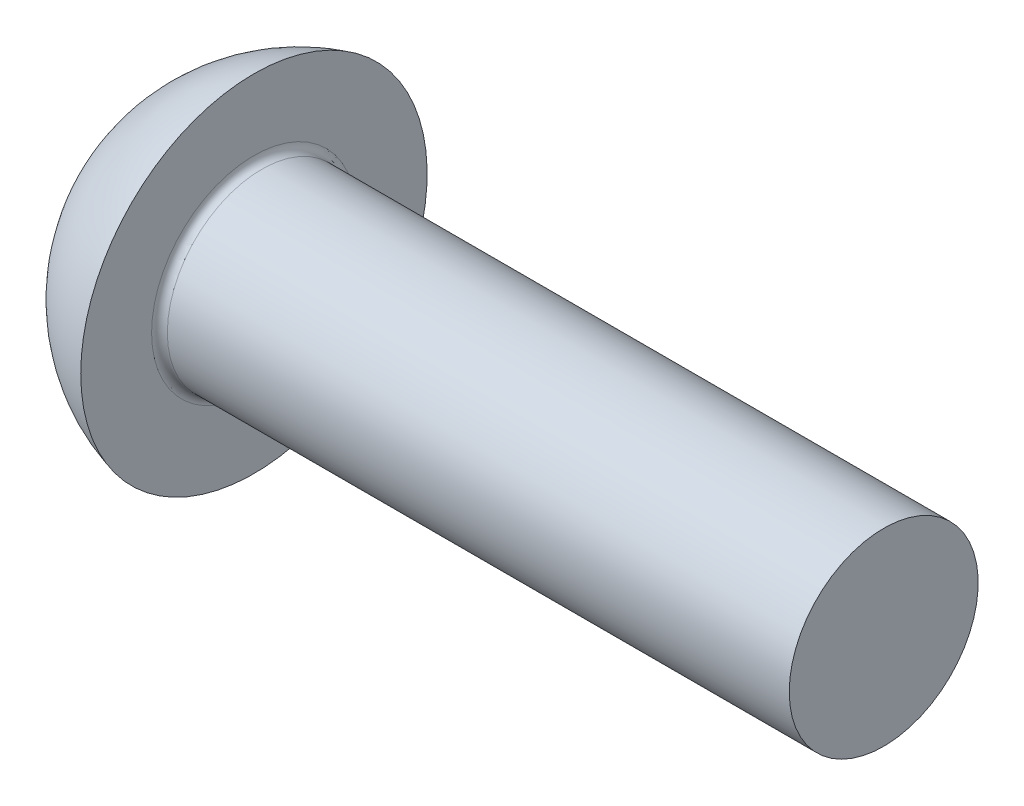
ISO-10303-21;
HEADER;
FILE_DESCRIPTION(('STEP AP214'),'2;1');
FILE_NAME('part.step','',(''),(''),'','','');
FILE_SCHEMA(('AUTOMOTIVE_DESIGN { 1 0 10303 214 1 1 1 1 }'));
ENDSEC;
DATA;
#1=APPLICATION_CONTEXT('core data for automotive mechanical design processes');
#2=APPLICATION_PROTOCOL_DEFINITION('international standard','automotive_design',2000,#1);
#3=PRODUCT_CONTEXT('',#1,'mechanical');
#4=PRODUCT('Part','Part','',(#3));
#5=PRODUCT_RELATED_PRODUCT_CATEGORY('part','',(#4));
#6=PRODUCT_DEFINITION_FORMATION('','',#4);
#7=PRODUCT_DEFINITION_CONTEXT('part definition',#1,'design');
#8=PRODUCT_DEFINITION('design','',#6,#7);
#9=PRODUCT_DEFINITION_SHAPE('','',#8);
#10=(LENGTH_UNIT() NAMED_UNIT(*) SI_UNIT(.MILLI.,.METRE.));
#11=(NAMED_UNIT(*) PLANE_ANGLE_UNIT() SI_UNIT($,.RADIAN.));
#12=(NAMED_UNIT(*) SI_UNIT($,.STERADIAN.) SOLID_ANGLE_UNIT());
#13=UNCERTAINTY_MEASURE_WITH_UNIT(LENGTH_MEASURE(1.E-05),#10,'distance_accuracy_value','');
#14=(GEOMETRIC_REPRESENTATION_CONTEXT(3) GLOBAL_UNCERTAINTY_ASSIGNED_CONTEXT((#13)) GLOBAL_UNIT_ASSIGNED_CONTEXT((#10,
#11,#12)) REPRESENTATION_CONTEXT('',''));
#15=CARTESIAN_POINT('',(0.,0.,0.));
#16=DIRECTION('',(0.,0.,1.));
#17=DIRECTION('',(1.,0.,0.));
#18=AXIS2_PLACEMENT_3D('',#15,#16,#17);
#19=CARTESIAN_POINT('',(48.5,0.,0.));
#20=DIRECTION('',(-1.,0.,0.));
#21=DIRECTION('',(0.,0.,1.));
#22=AXIS2_PLACEMENT_3D('',#19,#20,#21);
#23=PLANE('',#22);
#24=CARTESIAN_POINT('',(48.5,0.,0.));
#25=DIRECTION('',(-1.,0.,0.));
#26=DIRECTION('',(0.,0.,1.));
#27=AXIS2_PLACEMENT_3D('',#24,#25,#26);
#28=CIRCLE('',#27,6.);
#29=CARTESIAN_POINT('',(48.5,0.,6.));
#30=VERTEX_POINT('',#29);
#31=EDGE_CURVE('E45',#30,#30,#28,.T.);
#32=ORIENTED_EDGE('',*,*,#31,.F.);
#33=EDGE_LOOP('',(#32));
#34=FACE_BOUND('',#33,.T.);
#35=ADVANCED_FACE('F30',(#34),#23,.F.);
#36=CARTESIAN_POINT('',(11.3676470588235,0.,0.));
#37=DIRECTION('',(-1.,0.,0.));
#38=DIRECTION('',(0.,1.,0.));
#39=AXIS2_PLACEMENT_3D('',#36,#37,#38);
#40=SPHERICAL_SURFACE('',#39,11.3676470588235);
#41=CARTESIAN_POINT('',(8.5,0.,0.));
#42=DIRECTION('',(-1.,0.,0.));
#43=DIRECTION('',(0.,0.,1.));
#44=AXIS2_PLACEMENT_3D('',#41,#42,#43);
#45=CIRCLE('',#44,11.);
#46=CARTESIAN_POINT('',(8.5,0.,11.));
#47=VERTEX_POINT('',#46);
#48=EDGE_CURVE('E41',#47,#47,#45,.T.);
#49=ORIENTED_EDGE('',*,*,#48,.T.);
#50=EDGE_LOOP('',(#49));
#51=FACE_BOUND('',#50,.T.);
#52=ADVANCED_FACE('F54',(#51),#40,.T.);
#53=CARTESIAN_POINT('',(8.5,11.,0.));
#54=DIRECTION('',(-1.,0.,0.));
#55=DIRECTION('',(0.,0.,1.));
#56=AXIS2_PLACEMENT_3D('',#53,#54,#55);
#57=PLANE('',#56);
#58=CARTESIAN_POINT('',(8.5,0.,0.));
#59=DIRECTION('',(-1.,0.,0.));
#60=DIRECTION('',(0.,0.,1.));
#61=AXIS2_PLACEMENT_3D('',#58,#59,#60);
#62=CIRCLE('',#61,6.5);
#63=CARTESIAN_POINT('',(8.5,0.,6.5));
#64=VERTEX_POINT('',#63);
#65=EDGE_CURVE('E37',#64,#64,#62,.T.);
#66=ORIENTED_EDGE('',*,*,#65,.T.);
#67=EDGE_LOOP('',(#66));
#68=FACE_BOUND('',#67,.T.);
#69=ORIENTED_EDGE('',*,*,#48,.F.);
#70=EDGE_LOOP('',(#69));
#71=FACE_BOUND('',#70,.T.);
#72=ADVANCED_FACE('F58',(#68,#71),#57,.F.);
#73=CARTESIAN_POINT('',(42.010305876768,0.,0.));
#74=DIRECTION('',(-1.,0.,0.));
#75=DIRECTION('',(0.,0.,1.));
#76=AXIS2_PLACEMENT_3D('',#73,#74,#75);
#77=CYLINDRICAL_SURFACE('',#76,6.);
#78=CARTESIAN_POINT('',(9.,0.,0.));
#79=DIRECTION('',(-1.,0.,0.));
#80=DIRECTION('',(0.,0.,1.));
#81=AXIS2_PLACEMENT_3D('',#78,#79,#80);
#82=CIRCLE('',#81,6.);
#83=CARTESIAN_POINT('',(9.,0.,6.));
#84=VERTEX_POINT('',#83);
#85=EDGE_CURVE('E10',#84,#84,#82,.F.);
#86=ORIENTED_EDGE('',*,*,#85,.T.);
#87=EDGE_LOOP('',(#86));
#88=FACE_BOUND('',#87,.T.);
#89=ORIENTED_EDGE('',*,*,#31,.T.);
#90=EDGE_LOOP('',(#89));
#91=FACE_BOUND('',#90,.T.);
#92=ADVANCED_FACE('F51',(#88,#91),#77,.T.);
#93=CARTESIAN_POINT('',(9.,0.,0.));
#94=DIRECTION('',(-1.,0.,0.));
#95=DIRECTION('',(0.,0.,1.));
#96=AXIS2_PLACEMENT_3D('',#93,#94,#95);
#97=TOROIDAL_SURFACE('',#96,6.5,0.5);
#98=ORIENTED_EDGE('',*,*,#85,.F.);
#99=EDGE_LOOP('',(#98));
#100=FACE_BOUND('',#99,.T.);
#101=ORIENTED_EDGE('',*,*,#65,.F.);
#102=EDGE_LOOP('',(#101));
#103=FACE_BOUND('',#102,.T.);
#104=ADVANCED_FACE('F32',(#100,#103),#97,.F.);
#105=CLOSED_SHELL('',(#35,#52,#72,#92,#104));
#106=MANIFOLD_SOLID_BREP('B2',#105);
#107=ADVANCED_BREP_SHAPE_REPRESENTATION('',(#18,#106),#14);
#108=SHAPE_DEFINITION_REPRESENTATION(#9,#107);
ENDSEC;
END-ISO-10303-21;
